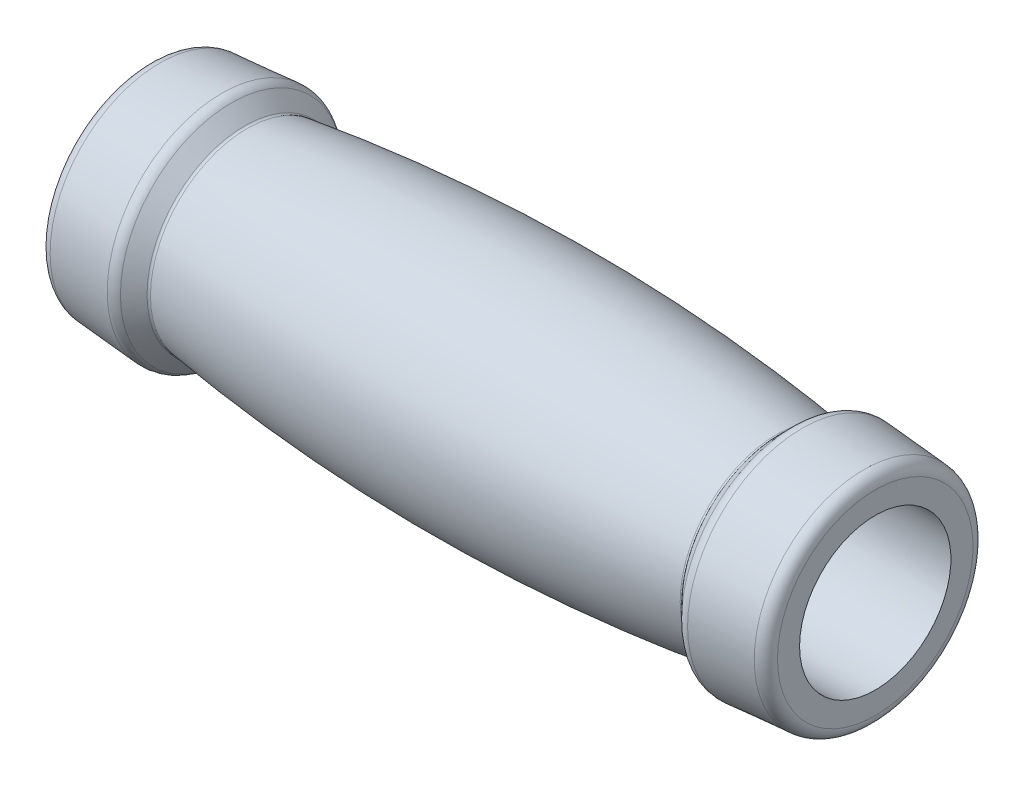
ISO-10303-21;
HEADER;
FILE_DESCRIPTION(('STEP AP214'),'2;1');
FILE_NAME('part.step','',(''),(''),'','','');
FILE_SCHEMA(('AUTOMOTIVE_DESIGN { 1 0 10303 214 1 1 1 1 }'));
ENDSEC;
DATA;
#1=APPLICATION_CONTEXT('core data for automotive mechanical design processes');
#2=APPLICATION_PROTOCOL_DEFINITION('international standard','automotive_design',2000,#1);
#3=PRODUCT_CONTEXT('',#1,'mechanical');
#4=PRODUCT('Part','Part','',(#3));
#5=PRODUCT_RELATED_PRODUCT_CATEGORY('part','',(#4));
#6=PRODUCT_DEFINITION_FORMATION('','',#4);
#7=PRODUCT_DEFINITION_CONTEXT('part definition',#1,'design');
#8=PRODUCT_DEFINITION('design','',#6,#7);
#9=PRODUCT_DEFINITION_SHAPE('','',#8);
#10=(LENGTH_UNIT() NAMED_UNIT(*) SI_UNIT(.MILLI.,.METRE.));
#11=(NAMED_UNIT(*) PLANE_ANGLE_UNIT() SI_UNIT($,.RADIAN.));
#12=(NAMED_UNIT(*) SI_UNIT($,.STERADIAN.) SOLID_ANGLE_UNIT());
#13=UNCERTAINTY_MEASURE_WITH_UNIT(LENGTH_MEASURE(1.E-05),#10,'distance_accuracy_value','');
#14=(GEOMETRIC_REPRESENTATION_CONTEXT(3) GLOBAL_UNCERTAINTY_ASSIGNED_CONTEXT((#13)) GLOBAL_UNIT_ASSIGNED_CONTEXT((#10,
#11,#12)) REPRESENTATION_CONTEXT('',''));
#15=CARTESIAN_POINT('',(0.,0.,0.));
#16=DIRECTION('',(0.,0.,1.));
#17=DIRECTION('',(1.,0.,0.));
#18=AXIS2_PLACEMENT_3D('',#15,#16,#17);
#19=CARTESIAN_POINT('',(60.,12.5,0.));
#20=DIRECTION('',(-1.,0.,0.));
#21=DIRECTION('',(0.,0.,1.));
#22=AXIS2_PLACEMENT_3D('',#19,#20,#21);
#23=PLANE('',#22);
#24=CARTESIAN_POINT('',(60.,0.,0.));
#25=DIRECTION('',(-1.,0.,0.));
#26=DIRECTION('',(0.,0.,1.));
#27=AXIS2_PLACEMENT_3D('',#24,#25,#26);
#28=CIRCLE('',#27,16.1479377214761);
#29=CARTESIAN_POINT('',(60.,0.,16.1479377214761));
#30=VERTEX_POINT('',#29);
#31=EDGE_CURVE('E10',#30,#30,#28,.T.);
#32=ORIENTED_EDGE('',*,*,#31,.F.);
#33=EDGE_LOOP('',(#32));
#34=FACE_BOUND('',#33,.T.);
#35=CARTESIAN_POINT('',(60.,0.,0.));
#36=DIRECTION('',(-1.,0.,0.));
#37=DIRECTION('',(0.,0.,1.));
#38=AXIS2_PLACEMENT_3D('',#35,#36,#37);
#39=CIRCLE('',#38,12.5);
#40=CARTESIAN_POINT('',(60.,0.,12.5));
#41=VERTEX_POINT('',#40);
#42=EDGE_CURVE('E78',#41,#41,#39,.T.);
#43=ORIENTED_EDGE('',*,*,#42,.T.);
#44=EDGE_LOOP('',(#43));
#45=FACE_BOUND('',#44,.T.);
#46=ADVANCED_FACE('F32',(#34,#45),#23,.F.);
#47=CARTESIAN_POINT('',(58.,0.,0.));
#48=DIRECTION('',(-1.,0.,0.));
#49=DIRECTION('',(0.,0.,1.));
#50=AXIS2_PLACEMENT_3D('',#47,#48,#49);
#51=TOROIDAL_SURFACE('',#50,16.1479377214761,2.);
#52=CARTESIAN_POINT('',(58.1533929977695,0.,0.));
#53=DIRECTION('',(-1.,0.,0.));
#54=DIRECTION('',(0.,0.,1.));
#55=AXIS2_PLACEMENT_3D('',#52,#53,#54);
#56=CIRCLE('',#55,18.1420466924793);
#57=CARTESIAN_POINT('',(58.1533929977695,0.,18.1420466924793));
#58=VERTEX_POINT('',#57);
#59=EDGE_CURVE('E38',#58,#58,#56,.T.);
#60=ORIENTED_EDGE('',*,*,#59,.F.);
#61=EDGE_LOOP('',(#60));
#62=FACE_BOUND('',#61,.T.);
#63=ORIENTED_EDGE('',*,*,#31,.T.);
#64=EDGE_LOOP('',(#63));
#65=FACE_BOUND('',#64,.T.);
#66=ADVANCED_FACE('F151',(#62,#65),#51,.T.);
#67=CARTESIAN_POINT('',(58.1533929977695,0.,0.));
#68=DIRECTION('',(-1.,0.,0.));
#69=DIRECTION('',(0.,0.,1.));
#70=AXIS2_PLACEMENT_3D('',#67,#68,#69);
#71=CONICAL_SURFACE('',#70,18.1420466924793,0.0767718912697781);
#72=CARTESIAN_POINT('',(47.9298682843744,0.,0.));
#73=DIRECTION('',(-1.,0.,0.));
#74=DIRECTION('',(0.,0.,1.));
#75=AXIS2_PLACEMENT_3D('',#72,#73,#74);
#76=CIRCLE('',#75,18.9284716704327);
#77=CARTESIAN_POINT('',(47.9298682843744,0.,18.9284716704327));
#78=VERTEX_POINT('',#77);
#79=EDGE_CURVE('E42',#78,#78,#76,.T.);
#80=ORIENTED_EDGE('',*,*,#79,.F.);
#81=EDGE_LOOP('',(#80));
#82=FACE_BOUND('',#81,.T.);
#83=ORIENTED_EDGE('',*,*,#59,.T.);
#84=EDGE_LOOP('',(#83));
#85=FACE_BOUND('',#84,.T.);
#86=ADVANCED_FACE('F146',(#82,#85),#71,.T.);
#87=CARTESIAN_POINT('',(47.7764752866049,0.,0.));
#88=DIRECTION('',(-1.,0.,0.));
#89=DIRECTION('',(0.,0.,1.));
#90=AXIS2_PLACEMENT_3D('',#87,#88,#89);
#91=TOROIDAL_SURFACE('',#90,16.9343626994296,2.);
#92=CARTESIAN_POINT('',(46.3474983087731,0.,0.));
#93=DIRECTION('',(-1.,0.,0.));
#94=DIRECTION('',(0.,0.,1.));
#95=AXIS2_PLACEMENT_3D('',#92,#93,#94);
#96=CIRCLE('',#95,18.3336570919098);
#97=CARTESIAN_POINT('',(46.3474983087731,0.,18.3336570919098));
#98=VERTEX_POINT('',#97);
#99=EDGE_CURVE('E46',#98,#98,#96,.T.);
#100=ORIENTED_EDGE('',*,*,#99,.F.);
#101=EDGE_LOOP('',(#100));
#102=FACE_BOUND('',#101,.T.);
#103=ORIENTED_EDGE('',*,*,#79,.T.);
#104=EDGE_LOOP('',(#103));
#105=FACE_BOUND('',#104,.T.);
#106=ADVANCED_FACE('F140',(#102,#105),#91,.T.);
#107=CARTESIAN_POINT('',(46.3474983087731,0.,0.));
#108=DIRECTION('',(1.,0.,0.));
#109=DIRECTION('',(0.,0.,-1.));
#110=AXIS2_PLACEMENT_3D('',#107,#108,#109);
#111=CONICAL_SURFACE('',#110,18.3336570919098,0.795892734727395);
#112=CARTESIAN_POINT('',(44.1764959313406,0.,0.));
#113=DIRECTION('',(-1.,0.,0.));
#114=DIRECTION('',(0.,0.,1.));
#115=AXIS2_PLACEMENT_3D('',#112,#113,#114);
#116=CIRCLE('',#115,16.1166022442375);
#117=CARTESIAN_POINT('',(44.1764959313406,0.,16.1166022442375));
#118=VERTEX_POINT('',#117);
#119=EDGE_CURVE('E51',#118,#118,#116,.T.);
#120=ORIENTED_EDGE('',*,*,#119,.F.);
#121=EDGE_LOOP('',(#120));
#122=FACE_BOUND('',#121,.T.);
#123=ORIENTED_EDGE('',*,*,#99,.T.);
#124=EDGE_LOOP('',(#123));
#125=FACE_BOUND('',#124,.T.);
#126=ADVANCED_FACE('F134',(#122,#125),#111,.T.);
#127=CARTESIAN_POINT('',(43.8192516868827,0.,0.));
#128=DIRECTION('',(-1.,0.,0.));
#129=DIRECTION('',(0.,0.,1.));
#130=AXIS2_PLACEMENT_3D('',#127,#128,#129);
#131=TOROIDAL_SURFACE('',#130,16.4664258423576,0.500000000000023);
#132=CARTESIAN_POINT('',(43.7503526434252,0.,0.));
#133=DIRECTION('',(-1.,0.,0.));
#134=DIRECTION('',(0.,0.,1.));
#135=AXIS2_PLACEMENT_3D('',#132,#133,#134);
#136=CIRCLE('',#135,15.97119567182);
#137=CARTESIAN_POINT('',(43.7503526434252,0.,15.97119567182));
#138=VERTEX_POINT('',#137);
#139=EDGE_CURVE('E54',#138,#138,#136,.T.);
#140=ORIENTED_EDGE('',*,*,#139,.F.);
#141=EDGE_LOOP('',(#140));
#142=FACE_BOUND('',#141,.T.);
#143=ORIENTED_EDGE('',*,*,#119,.T.);
#144=EDGE_LOOP('',(#143));
#145=FACE_BOUND('',#144,.T.);
#146=ADVANCED_FACE('F128',(#142,#145),#131,.F.);
#147=CARTESIAN_POINT('',(0.,0.,0.));
#148=DIRECTION('',(-1.,0.,0.));
#149=DIRECTION('',(0.,0.,1.));
#150=AXIS2_PLACEMENT_3D('',#147,#148,#149);
#151=DEGENERATE_TOROIDAL_SURFACE('',#150,298.496081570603,317.496081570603,.F.);
#152=CARTESIAN_POINT('',(-43.7503526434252,0.,0.));
#153=DIRECTION('',(-1.,0.,0.));
#154=DIRECTION('',(0.,0.,1.));
#155=AXIS2_PLACEMENT_3D('',#152,#153,#154);
#156=CIRCLE('',#155,15.97119567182);
#157=CARTESIAN_POINT('',(-43.7503526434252,0.,15.97119567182));
#158=VERTEX_POINT('',#157);
#159=EDGE_CURVE('E57',#158,#158,#156,.T.);
#160=ORIENTED_EDGE('',*,*,#159,.F.);
#161=EDGE_LOOP('',(#160));
#162=FACE_BOUND('',#161,.T.);
#163=ORIENTED_EDGE('',*,*,#139,.T.);
#164=EDGE_LOOP('',(#163));
#165=FACE_BOUND('',#164,.T.);
#166=ADVANCED_FACE('F122',(#162,#165),#151,.F.);
#167=CARTESIAN_POINT('',(-43.8192516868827,0.,0.));
#168=DIRECTION('',(-1.,0.,0.));
#169=DIRECTION('',(0.,0.,1.));
#170=AXIS2_PLACEMENT_3D('',#167,#168,#169);
#171=TOROIDAL_SURFACE('',#170,16.4664258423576,0.500000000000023);
#172=CARTESIAN_POINT('',(-44.1764959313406,0.,0.));
#173=DIRECTION('',(-1.,0.,0.));
#174=DIRECTION('',(0.,0.,1.));
#175=AXIS2_PLACEMENT_3D('',#172,#173,#174);
#176=CIRCLE('',#175,16.1166022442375);
#177=CARTESIAN_POINT('',(-44.1764959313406,0.,16.1166022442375));
#178=VERTEX_POINT('',#177);
#179=EDGE_CURVE('E60',#178,#178,#176,.T.);
#180=ORIENTED_EDGE('',*,*,#179,.F.);
#181=EDGE_LOOP('',(#180));
#182=FACE_BOUND('',#181,.T.);
#183=ORIENTED_EDGE('',*,*,#159,.T.);
#184=EDGE_LOOP('',(#183));
#185=FACE_BOUND('',#184,.T.);
#186=ADVANCED_FACE('F116',(#182,#185),#171,.F.);
#187=CARTESIAN_POINT('',(-44.1764959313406,0.,0.));
#188=DIRECTION('',(-1.,0.,0.));
#189=DIRECTION('',(0.,0.,1.));
#190=AXIS2_PLACEMENT_3D('',#187,#188,#189);
#191=CONICAL_SURFACE('',#190,16.1166022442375,0.795892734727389);
#192=CARTESIAN_POINT('',(-46.3474983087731,0.,0.));
#193=DIRECTION('',(-1.,0.,0.));
#194=DIRECTION('',(0.,0.,1.));
#195=AXIS2_PLACEMENT_3D('',#192,#193,#194);
#196=CIRCLE('',#195,18.3336570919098);
#197=CARTESIAN_POINT('',(-46.3474983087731,0.,18.3336570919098));
#198=VERTEX_POINT('',#197);
#199=EDGE_CURVE('E63',#198,#198,#196,.T.);
#200=ORIENTED_EDGE('',*,*,#199,.F.);
#201=EDGE_LOOP('',(#200));
#202=FACE_BOUND('',#201,.T.);
#203=ORIENTED_EDGE('',*,*,#179,.T.);
#204=EDGE_LOOP('',(#203));
#205=FACE_BOUND('',#204,.T.);
#206=ADVANCED_FACE('F110',(#202,#205),#191,.T.);
#207=CARTESIAN_POINT('',(-47.7764752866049,0.,0.));
#208=DIRECTION('',(-1.,0.,0.));
#209=DIRECTION('',(0.,0.,1.));
#210=AXIS2_PLACEMENT_3D('',#207,#208,#209);
#211=TOROIDAL_SURFACE('',#210,16.9343626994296,2.);
#212=CARTESIAN_POINT('',(-47.9298682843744,0.,0.));
#213=DIRECTION('',(-1.,0.,0.));
#214=DIRECTION('',(0.,0.,1.));
#215=AXIS2_PLACEMENT_3D('',#212,#213,#214);
#216=CIRCLE('',#215,18.9284716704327);
#217=CARTESIAN_POINT('',(-47.9298682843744,0.,18.9284716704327));
#218=VERTEX_POINT('',#217);
#219=EDGE_CURVE('E66',#218,#218,#216,.T.);
#220=ORIENTED_EDGE('',*,*,#219,.F.);
#221=EDGE_LOOP('',(#220));
#222=FACE_BOUND('',#221,.T.);
#223=ORIENTED_EDGE('',*,*,#199,.T.);
#224=EDGE_LOOP('',(#223));
#225=FACE_BOUND('',#224,.T.);
#226=ADVANCED_FACE('F104',(#222,#225),#211,.T.);
#227=CARTESIAN_POINT('',(-47.9298682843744,0.,0.));
#228=DIRECTION('',(1.,0.,0.));
#229=DIRECTION('',(0.,0.,-1.));
#230=AXIS2_PLACEMENT_3D('',#227,#228,#229);
#231=CONICAL_SURFACE('',#230,18.9284716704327,0.0767718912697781);
#232=CARTESIAN_POINT('',(-58.1533929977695,0.,0.));
#233=DIRECTION('',(-1.,0.,0.));
#234=DIRECTION('',(0.,0.,1.));
#235=AXIS2_PLACEMENT_3D('',#232,#233,#234);
#236=CIRCLE('',#235,18.1420466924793);
#237=CARTESIAN_POINT('',(-58.1533929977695,0.,18.1420466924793));
#238=VERTEX_POINT('',#237);
#239=EDGE_CURVE('E69',#238,#238,#236,.T.);
#240=ORIENTED_EDGE('',*,*,#239,.F.);
#241=EDGE_LOOP('',(#240));
#242=FACE_BOUND('',#241,.T.);
#243=ORIENTED_EDGE('',*,*,#219,.T.);
#244=EDGE_LOOP('',(#243));
#245=FACE_BOUND('',#244,.T.);
#246=ADVANCED_FACE('F98',(#242,#245),#231,.T.);
#247=CARTESIAN_POINT('',(-58.,0.,0.));
#248=DIRECTION('',(-1.,0.,0.));
#249=DIRECTION('',(0.,0.,1.));
#250=AXIS2_PLACEMENT_3D('',#247,#248,#249);
#251=TOROIDAL_SURFACE('',#250,16.1479377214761,2.);
#252=CARTESIAN_POINT('',(-60.,0.,0.));
#253=DIRECTION('',(-1.,0.,0.));
#254=DIRECTION('',(0.,0.,1.));
#255=AXIS2_PLACEMENT_3D('',#252,#253,#254);
#256=CIRCLE('',#255,16.1479377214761);
#257=CARTESIAN_POINT('',(-60.,0.,16.1479377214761));
#258=VERTEX_POINT('',#257);
#259=EDGE_CURVE('E72',#258,#258,#256,.T.);
#260=ORIENTED_EDGE('',*,*,#259,.F.);
#261=EDGE_LOOP('',(#260));
#262=FACE_BOUND('',#261,.T.);
#263=ORIENTED_EDGE('',*,*,#239,.T.);
#264=EDGE_LOOP('',(#263));
#265=FACE_BOUND('',#264,.T.);
#266=ADVANCED_FACE('F92',(#262,#265),#251,.T.);
#267=CARTESIAN_POINT('',(-60.,12.5,0.));
#268=DIRECTION('',(1.,0.,0.));
#269=DIRECTION('',(0.,0.,-1.));
#270=AXIS2_PLACEMENT_3D('',#267,#268,#269);
#271=PLANE('',#270);
#272=CARTESIAN_POINT('',(-60.,0.,0.));
#273=DIRECTION('',(-1.,0.,0.));
#274=DIRECTION('',(0.,0.,1.));
#275=AXIS2_PLACEMENT_3D('',#272,#273,#274);
#276=CIRCLE('',#275,12.5);
#277=CARTESIAN_POINT('',(-60.,0.,12.5));
#278=VERTEX_POINT('',#277);
#279=EDGE_CURVE('E75',#278,#278,#276,.T.);
#280=ORIENTED_EDGE('',*,*,#279,.F.);
#281=EDGE_LOOP('',(#280));
#282=FACE_BOUND('',#281,.T.);
#283=ORIENTED_EDGE('',*,*,#259,.T.);
#284=EDGE_LOOP('',(#283));
#285=FACE_BOUND('',#284,.T.);
#286=ADVANCED_FACE('F86',(#282,#285),#271,.F.);
#287=CARTESIAN_POINT('',(0.,0.,0.));
#288=DIRECTION('',(-1.,0.,0.));
#289=DIRECTION('',(0.,0.,1.));
#290=AXIS2_PLACEMENT_3D('',#287,#288,#289);
#291=CYLINDRICAL_SURFACE('',#290,12.5);
#292=ORIENTED_EDGE('',*,*,#42,.F.);
#293=EDGE_LOOP('',(#292));
#294=FACE_BOUND('',#293,.T.);
#295=ORIENTED_EDGE('',*,*,#279,.T.);
#296=EDGE_LOOP('',(#295));
#297=FACE_BOUND('',#296,.T.);
#298=ADVANCED_FACE('F83',(#294,#297),#291,.F.);
#299=CLOSED_SHELL('',(#46,#66,#86,#106,#126,#146,#166,#186,#206,#226,#246,#266,#286,#298));
#300=MANIFOLD_SOLID_BREP('B2',#299);
#301=ADVANCED_BREP_SHAPE_REPRESENTATION('',(#18,#300),#14);
#302=SHAPE_DEFINITION_REPRESENTATION(#9,#301);
ENDSEC;
END-ISO-10303-21;
